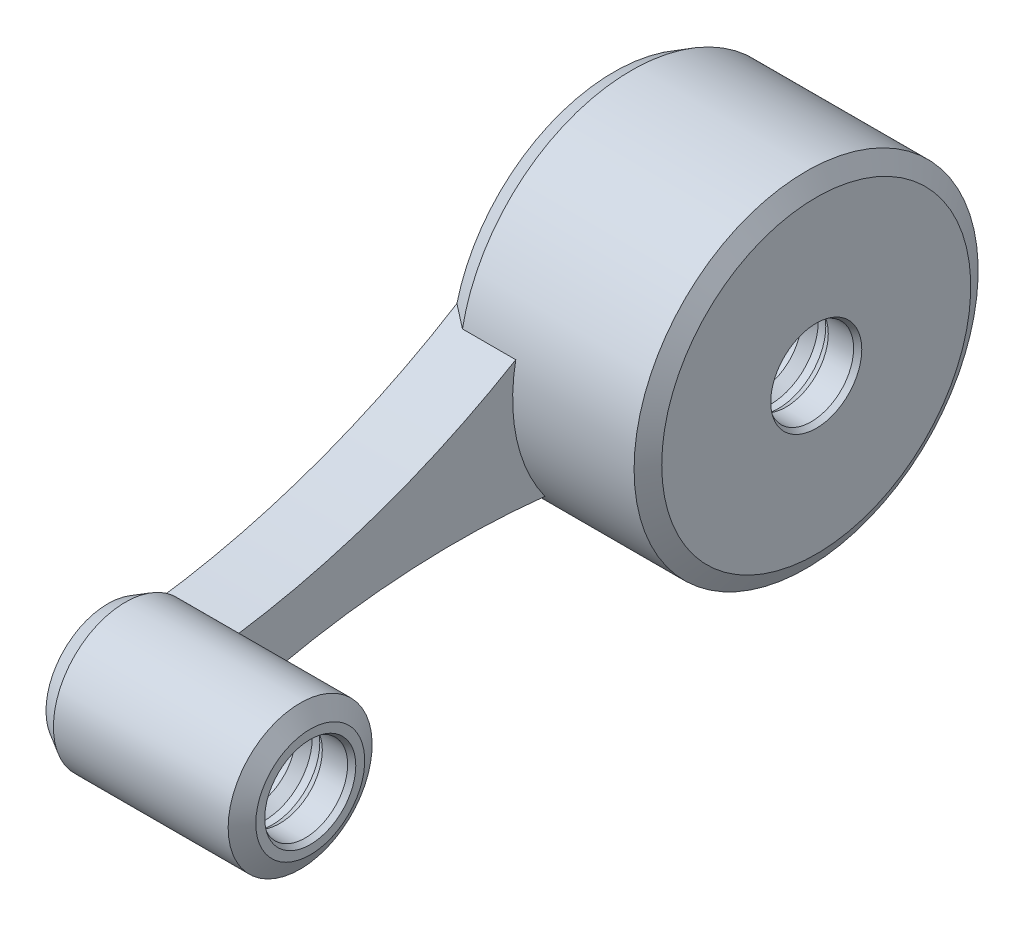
ISO-10303-21;
HEADER;
FILE_DESCRIPTION(('STEP AP214'),'2;1');
FILE_NAME('part.step','',(''),(''),'','','');
FILE_SCHEMA(('AUTOMOTIVE_DESIGN { 1 0 10303 214 1 1 1 1 }'));
ENDSEC;
DATA;
#1=APPLICATION_CONTEXT('core data for automotive mechanical design processes');
#2=APPLICATION_PROTOCOL_DEFINITION('international standard','automotive_design',2000,#1);
#3=PRODUCT_CONTEXT('',#1,'mechanical');
#4=PRODUCT('Part','Part','',(#3));
#5=PRODUCT_RELATED_PRODUCT_CATEGORY('part','',(#4));
#6=PRODUCT_DEFINITION_FORMATION('','',#4);
#7=PRODUCT_DEFINITION_CONTEXT('part definition',#1,'design');
#8=PRODUCT_DEFINITION('design','',#6,#7);
#9=PRODUCT_DEFINITION_SHAPE('','',#8);
#10=(LENGTH_UNIT() NAMED_UNIT(*) SI_UNIT(.MILLI.,.METRE.));
#11=(NAMED_UNIT(*) PLANE_ANGLE_UNIT() SI_UNIT($,.RADIAN.));
#12=(NAMED_UNIT(*) SI_UNIT($,.STERADIAN.) SOLID_ANGLE_UNIT());
#13=UNCERTAINTY_MEASURE_WITH_UNIT(LENGTH_MEASURE(1.E-05),#10,'distance_accuracy_value','');
#14=(GEOMETRIC_REPRESENTATION_CONTEXT(3) GLOBAL_UNCERTAINTY_ASSIGNED_CONTEXT((#13)) GLOBAL_UNIT_ASSIGNED_CONTEXT((#10,
#11,#12)) REPRESENTATION_CONTEXT('',''));
#15=CARTESIAN_POINT('',(0.,0.,0.));
#16=DIRECTION('',(0.,0.,1.));
#17=DIRECTION('',(1.,0.,0.));
#18=AXIS2_PLACEMENT_3D('',#15,#16,#17);
#19=CARTESIAN_POINT('',(20.,0.,0.));
#20=DIRECTION('',(1.,0.,0.));
#21=DIRECTION('',(0.,0.,1.));
#22=AXIS2_PLACEMENT_3D('',#19,#20,#21);
#23=PLANE('',#22);
#24=CARTESIAN_POINT('',(20.,0.,0.));
#25=DIRECTION('',(-1.,0.,0.));
#26=DIRECTION('',(0.,0.,1.));
#27=AXIS2_PLACEMENT_3D('',#24,#25,#26);
#28=CIRCLE('',#27,5.38218136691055);
#29=CARTESIAN_POINT('',(20.,0.,5.38218136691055));
#30=VERTEX_POINT('',#29);
#31=EDGE_CURVE('E107',#30,#30,#28,.T.);
#32=ORIENTED_EDGE('',*,*,#31,.F.);
#33=EDGE_LOOP('',(#32));
#34=FACE_BOUND('',#33,.T.);
#35=CARTESIAN_POINT('',(20.,0.,0.));
#36=DIRECTION('',(1.,0.,0.));
#37=DIRECTION('',(0.,0.,-1.));
#38=AXIS2_PLACEMENT_3D('',#35,#36,#37);
#39=CIRCLE('',#38,4.5);
#40=CARTESIAN_POINT('',(20.,0.,-4.5));
#41=VERTEX_POINT('',#40);
#42=EDGE_CURVE('E436',#41,#41,#39,.T.);
#43=ORIENTED_EDGE('',*,*,#42,.F.);
#44=EDGE_LOOP('',(#43));
#45=FACE_BOUND('',#44,.T.);
#46=ADVANCED_FACE('F38',(#34,#45),#23,.T.);
#47=CARTESIAN_POINT('',(20.,10.6190847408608,-50.));
#48=DIRECTION('',(1.,0.,0.));
#49=DIRECTION('',(0.,0.,1.));
#50=AXIS2_PLACEMENT_3D('',#47,#48,#49);
#51=PLANE('',#50);
#52=CARTESIAN_POINT('',(20.,10.6190847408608,-50.));
#53=DIRECTION('',(-1.,0.,0.));
#54=DIRECTION('',(0.,0.,1.));
#55=AXIS2_PLACEMENT_3D('',#52,#53,#54);
#56=CIRCLE('',#55,15.2679491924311);
#57=CARTESIAN_POINT('',(20.,10.6190847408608,-34.7320508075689));
#58=VERTEX_POINT('',#57);
#59=EDGE_CURVE('E182',#58,#58,#56,.T.);
#60=ORIENTED_EDGE('',*,*,#59,.F.);
#61=EDGE_LOOP('',(#60));
#62=FACE_BOUND('',#61,.T.);
#63=CARTESIAN_POINT('',(20.,10.6190847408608,-50.));
#64=DIRECTION('',(1.,0.,0.));
#65=DIRECTION('',(0.,0.,-1.));
#66=AXIS2_PLACEMENT_3D('',#63,#64,#65);
#67=CIRCLE('',#66,4.5);
#68=CARTESIAN_POINT('',(20.,10.6190847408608,-54.5));
#69=VERTEX_POINT('',#68);
#70=EDGE_CURVE('E239',#69,#69,#67,.T.);
#71=ORIENTED_EDGE('',*,*,#70,.F.);
#72=EDGE_LOOP('',(#71));
#73=FACE_BOUND('',#72,.T.);
#74=ADVANCED_FACE('F166',(#62,#73),#51,.T.);
#75=CARTESIAN_POINT('',(0.,0.,0.));
#76=DIRECTION('',(1.,0.,0.));
#77=DIRECTION('',(0.,0.,1.));
#78=AXIS2_PLACEMENT_3D('',#75,#76,#77);
#79=PLANE('',#78);
#80=CARTESIAN_POINT('',(0.,10.6190847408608,-50.));
#81=DIRECTION('',(1.,0.,0.));
#82=DIRECTION('',(0.,0.,-1.));
#83=AXIS2_PLACEMENT_3D('',#80,#81,#82);
#84=CIRCLE('',#83,4.5);
#85=CARTESIAN_POINT('',(0.,10.6190847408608,-54.5));
#86=VERTEX_POINT('',#85);
#87=EDGE_CURVE('E219',#86,#86,#84,.T.);
#88=ORIENTED_EDGE('',*,*,#87,.T.);
#89=EDGE_LOOP('',(#88));
#90=FACE_BOUND('',#89,.T.);
#91=CARTESIAN_POINT('',(0.,-79.2534363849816,-27.4855740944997));
#92=DIRECTION('',(1.,0.,0.));
#93=DIRECTION('',(0.,0.,1.));
#94=AXIS2_PLACEMENT_3D('',#91,#92,#93);
#95=CIRCLE('',#94,80.4312519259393);
#96=CARTESIAN_POINT('',(0.,0.542951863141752,-37.5713417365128));
#97=VERTEX_POINT('',#96);
#98=CARTESIAN_POINT('',(0.,-1.78755789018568,-5.84709088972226));
#99=VERTEX_POINT('',#98);
#100=EDGE_CURVE('E101',#97,#99,#95,.T.);
#101=ORIENTED_EDGE('',*,*,#100,.T.);
#102=CARTESIAN_POINT('',(0.,0.,0.));
#103=DIRECTION('',(-1.,0.,0.));
#104=DIRECTION('',(0.,0.,1.));
#105=AXIS2_PLACEMENT_3D('',#102,#103,#104);
#106=CIRCLE('',#105,6.11423217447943);
#107=CARTESIAN_POINT('',(0.,3.92829293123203,-4.685333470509));
#108=VERTEX_POINT('',#107);
#109=EDGE_CURVE('E110',#108,#99,#106,.F.);
#110=ORIENTED_EDGE('',*,*,#109,.F.);
#111=CARTESIAN_POINT('',(0.,78.5679863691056,5.13014934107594));
#112=DIRECTION('',(1.,0.,0.));
#113=DIRECTION('',(0.,0.,1.));
#114=AXIS2_PLACEMENT_3D('',#111,#112,#113);
#115=CIRCLE('',#114,75.2823189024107);
#116=CARTESIAN_POINT('',(0.,14.5561375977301,-34.4919500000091));
#117=VERTEX_POINT('',#116);
#118=EDGE_CURVE('E124',#108,#117,#115,.T.);
#119=ORIENTED_EDGE('',*,*,#118,.T.);
#120=CARTESIAN_POINT('',(0.,10.6190847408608,-50.));
#121=DIRECTION('',(-1.,0.,0.));
#122=DIRECTION('',(0.,0.,1.));
#123=AXIS2_PLACEMENT_3D('',#120,#121,#122);
#124=CIRCLE('',#123,16.);
#125=EDGE_CURVE('E121',#97,#117,#124,.F.);
#126=ORIENTED_EDGE('',*,*,#125,.F.);
#127=EDGE_LOOP('',(#101,#110,#119,#126));
#128=FACE_BOUND('',#127,.T.);
#129=CARTESIAN_POINT('',(0.,0.,0.));
#130=DIRECTION('',(1.,0.,0.));
#131=DIRECTION('',(0.,0.,-1.));
#132=AXIS2_PLACEMENT_3D('',#129,#130,#131);
#133=CIRCLE('',#132,4.5);
#134=CARTESIAN_POINT('',(0.,0.,-4.5));
#135=VERTEX_POINT('',#134);
#136=EDGE_CURVE('E272',#135,#135,#133,.T.);
#137=ORIENTED_EDGE('',*,*,#136,.T.);
#138=EDGE_LOOP('',(#137));
#139=FACE_BOUND('',#138,.T.);
#140=ADVANCED_FACE('F119',(#90,#128,#139),#79,.F.);
#141=CARTESIAN_POINT('',(6.99999999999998,39.2839931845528,2.56507467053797));
#142=DIRECTION('',(1.,0.,0.));
#143=DIRECTION('',(0.,0.,1.));
#144=AXIS2_PLACEMENT_3D('',#141,#142,#143);
#145=PLANE('',#144);
#146=CARTESIAN_POINT('',(6.99999999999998,78.5679863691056,5.13014934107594));
#147=DIRECTION('',(1.,0.,0.));
#148=DIRECTION('',(0.,0.,1.));
#149=AXIS2_PLACEMENT_3D('',#146,#147,#148);
#150=CIRCLE('',#149,75.2823189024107);
#151=CARTESIAN_POINT('',(6.99999999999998,4.08678037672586,-5.82327447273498));
#152=VERTEX_POINT('',#151);
#153=CARTESIAN_POINT('',(6.99999999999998,13.8379888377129,-33.3075269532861));
#154=VERTEX_POINT('',#153);
#155=EDGE_CURVE('E123',#152,#154,#150,.T.);
#156=ORIENTED_EDGE('',*,*,#155,.F.);
#157=CARTESIAN_POINT('',(6.99999999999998,0.,0.));
#158=DIRECTION('',(-1.,0.,0.));
#159=DIRECTION('',(0.,0.,1.));
#160=AXIS2_PLACEMENT_3D('',#157,#158,#159);
#161=CIRCLE('',#160,7.11423217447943);
#162=CARTESIAN_POINT('',(6.99999999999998,-1.48598416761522,-6.95730914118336));
#163=VERTEX_POINT('',#162);
#164=EDGE_CURVE('E199',#152,#163,#161,.T.);
#165=ORIENTED_EDGE('',*,*,#164,.T.);
#166=CARTESIAN_POINT('',(6.99999999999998,-79.2534363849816,-27.4855740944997));
#167=DIRECTION('',(1.,0.,0.));
#168=DIRECTION('',(0.,0.,1.));
#169=AXIS2_PLACEMENT_3D('',#166,#167,#168);
#170=CIRCLE('',#169,80.4312519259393);
#171=CARTESIAN_POINT('',(6.99999999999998,0.705437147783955,-36.1898735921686));
#172=VERTEX_POINT('',#171);
#173=EDGE_CURVE('E127',#172,#163,#170,.T.);
#174=ORIENTED_EDGE('',*,*,#173,.F.);
#175=CARTESIAN_POINT('',(6.99999999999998,10.6190847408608,-50.));
#176=DIRECTION('',(-1.,0.,0.));
#177=DIRECTION('',(0.,0.,1.));
#178=AXIS2_PLACEMENT_3D('',#175,#176,#177);
#179=CIRCLE('',#178,17.);
#180=EDGE_CURVE('E181',#154,#172,#179,.F.);
#181=ORIENTED_EDGE('',*,*,#180,.F.);
#182=EDGE_LOOP('',(#156,#165,#174,#181));
#183=FACE_BOUND('',#182,.T.);
#184=ADVANCED_FACE('F165',(#183),#145,.T.);
#185=CARTESIAN_POINT('',(6.99999999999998,78.5679863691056,5.13014934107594));
#186=DIRECTION('',(-1.,0.,0.));
#187=DIRECTION('',(0.,0.,-1.));
#188=AXIS2_PLACEMENT_3D('',#185,#186,#187);
#189=CYLINDRICAL_SURFACE('',#188,75.2823189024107);
#190=DIRECTION('',(-1.,0.,0.));
#191=VECTOR('',#190,1.);
#192=CARTESIAN_POINT('',(10.3660254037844,13.837988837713,-33.3075269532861));
#193=LINE('',#192,#191);
#194=CARTESIAN_POINT('',(1.73205080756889,13.8379888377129,-33.3075269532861));
#195=VERTEX_POINT('',#194);
#196=EDGE_CURVE('E129',#154,#195,#193,.T.);
#197=ORIENTED_EDGE('',*,*,#196,.T.);
#198=CARTESIAN_POINT('',(-0.000200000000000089,14.5562250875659,-34.4920913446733));
#199=CARTESIAN_POINT('',(0.141981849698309,14.4940295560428,-34.3916105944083));
#200=CARTESIAN_POINT('',(0.28477998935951,14.4324615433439,-34.2916163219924));
#201=CARTESIAN_POINT('',(0.571493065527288,14.3105184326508,-34.092535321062));
#202=CARTESIAN_POINT('',(0.715407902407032,14.2501432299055,-33.9934485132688));
#203=CARTESIAN_POINT('',(1.00426270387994,14.1305130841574,-33.7961000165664));
#204=CARTESIAN_POINT('',(1.14920266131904,14.0712581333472,-33.6978383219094));
#205=CARTESIAN_POINT('',(1.44003606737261,13.9538047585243,-33.5020664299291));
#206=CARTESIAN_POINT('',(1.58592959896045,13.8956064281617,-33.4045562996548));
#207=CARTESIAN_POINT('',(1.7322508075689,13.8379099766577,-33.3073941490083));
#208=B_SPLINE_CURVE_WITH_KNOTS('',3,(#198,#199,#200,#201,#202,#203,#204,#205,#206,#207),
.UNSPECIFIED.,.F.,.F.,(4,2,2,2,4),(0.,0.554632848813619,1.10921677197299,1.66379682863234,
2.21842580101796),.UNSPECIFIED.);
#209=EDGE_CURVE('E61',#117,#195,#208,.T.);
#210=ORIENTED_EDGE('',*,*,#209,.F.);
#211=ORIENTED_EDGE('',*,*,#118,.F.);
#212=CARTESIAN_POINT('',(-0.000199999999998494,3.92827508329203,-4.68519774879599));
#213=CARTESIAN_POINT('',(0.142778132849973,3.94103367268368,-4.78221572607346));
#214=CARTESIAN_POINT('',(0.286177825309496,3.95389989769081,-4.87859542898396));
#215=CARTESIAN_POINT('',(0.573701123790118,3.97985534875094,-5.0702239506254));
#216=CARTESIAN_POINT('',(0.717824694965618,3.99294456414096,-5.16547282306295));
#217=CARTESIAN_POINT('',(1.00668894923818,4.01935482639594,-5.35499375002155));
#218=CARTESIAN_POINT('',(1.15142962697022,4.03267587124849,-5.44926581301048));
#219=CARTESIAN_POINT('',(1.4414546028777,4.0595568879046,-5.6369511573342));
#220=CARTESIAN_POINT('',(1.58673892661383,4.07311687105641,-5.73036439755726));
#221=CARTESIAN_POINT('',(1.73225080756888,4.08679918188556,-5.82340234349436));
#222=B_SPLINE_CURVE_WITH_KNOTS('',3,(#212,#213,#214,#215,#216,#217,#218,#219,#220,#221),
.UNSPECIFIED.,.F.,.F.,(4,2,2,2,4),(0.,0.51976722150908,1.03950965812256,1.55924758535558,
2.07901026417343),.UNSPECIFIED.);
#223=CARTESIAN_POINT('',(1.73205080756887,4.08678037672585,-5.82327447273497));
#224=VERTEX_POINT('',#223);
#225=EDGE_CURVE('E106',#108,#224,#222,.T.);
#226=ORIENTED_EDGE('',*,*,#225,.T.);
#227=DIRECTION('',(-1.,0.,0.));
#228=VECTOR('',#227,1.);
#229=CARTESIAN_POINT('',(3.49999999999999,4.08678037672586,-5.82327447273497));
#230=LINE('',#229,#228);
#231=EDGE_CURVE('E134',#152,#224,#230,.T.);
#232=ORIENTED_EDGE('',*,*,#231,.F.);
#233=ORIENTED_EDGE('',*,*,#155,.T.);
#234=EDGE_LOOP('',(#197,#210,#211,#226,#232,#233));
#235=FACE_BOUND('',#234,.T.);
#236=ADVANCED_FACE('F170',(#235),#189,.F.);
#237=CARTESIAN_POINT('',(6.99999999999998,-79.2534363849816,-27.4855740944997));
#238=DIRECTION('',(-1.,0.,0.));
#239=DIRECTION('',(0.,0.,-1.));
#240=AXIS2_PLACEMENT_3D('',#237,#238,#239);
#241=CYLINDRICAL_SURFACE('',#240,80.4312519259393);
#242=DIRECTION('',(-1.,0.,0.));
#243=VECTOR('',#242,1.);
#244=CARTESIAN_POINT('',(10.3660254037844,0.705437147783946,-36.1898735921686));
#245=LINE('',#244,#243);
#246=CARTESIAN_POINT('',(1.73205080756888,0.705437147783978,-36.1898735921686));
#247=VERTEX_POINT('',#246);
#248=EDGE_CURVE('E11',#247,#172,#245,.F.);
#249=ORIENTED_EDGE('',*,*,#248,.T.);
#250=ORIENTED_EDGE('',*,*,#173,.T.);
#251=DIRECTION('',(-1.,0.,0.));
#252=VECTOR('',#251,1.);
#253=CARTESIAN_POINT('',(4.36602540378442,-1.4859841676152,-6.95730914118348));
#254=LINE('',#253,#252);
#255=CARTESIAN_POINT('',(1.73205080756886,-1.4859841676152,-6.95730914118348));
#256=VERTEX_POINT('',#255);
#257=EDGE_CURVE('E103',#256,#163,#254,.F.);
#258=ORIENTED_EDGE('',*,*,#257,.F.);
#259=CARTESIAN_POINT('',(1.73225080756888,-1.48595113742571,-6.95743427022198));
#260=CARTESIAN_POINT('',(1.58673608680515,-1.50998433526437,-6.86638948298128));
#261=CARTESIAN_POINT('',(1.44144955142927,-1.53426725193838,-6.77504447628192));
#262=CARTESIAN_POINT('',(1.15142147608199,-1.58336930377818,-6.59165185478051));
#263=CARTESIAN_POINT('',(1.00667991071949,-1.60818841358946,-6.49960427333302));
#264=CARTESIAN_POINT('',(0.717815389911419,-1.65840211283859,-6.314694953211));
#265=CARTESIAN_POINT('',(0.573692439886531,-1.68379670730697,-6.2218332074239));
#266=CARTESIAN_POINT('',(0.286172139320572,-1.73521300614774,-6.03515014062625));
#267=CARTESIAN_POINT('',(0.142774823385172,-1.7612347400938,-5.94132877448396));
#268=CARTESIAN_POINT('',(-0.000199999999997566,-1.78759476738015,-5.84695886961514));
#269=B_SPLINE_CURVE_WITH_KNOTS('',3,(#259,#260,#261,#262,#263,#264,#265,#266,#267,#268),
.UNSPECIFIED.,.F.,.F.,(4,2,2,2,4),(0.,0.519973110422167,1.03992168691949,1.55987481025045,
2.07985250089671),.UNSPECIFIED.);
#270=EDGE_CURVE('E96',#256,#99,#269,.T.);
#271=ORIENTED_EDGE('',*,*,#270,.T.);
#272=ORIENTED_EDGE('',*,*,#100,.F.);
#273=CARTESIAN_POINT('',(1.7322508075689,0.70545393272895,-36.1897194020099));
#274=CARTESIAN_POINT('',(1.58591737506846,0.693172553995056,-36.3025373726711));
#275=CARTESIAN_POINT('',(1.44001447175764,0.680592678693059,-36.4158829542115));
#276=CARTESIAN_POINT('',(1.14916825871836,0.654811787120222,-36.6437022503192));
#277=CARTESIAN_POINT('',(1.00422486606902,0.641610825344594,-36.7581758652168));
#278=CARTESIAN_POINT('',(0.715369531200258,0.614561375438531,-36.9883446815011));
#279=CARTESIAN_POINT('',(0.571457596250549,0.60071288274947,-37.1040398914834));
#280=CARTESIAN_POINT('',(0.284757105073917,0.572337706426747,-37.3367570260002));
#281=CARTESIAN_POINT('',(0.14196864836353,0.557810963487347,-37.453779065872));
#282=CARTESIAN_POINT('',(-0.00019999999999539,0.54293092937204,-37.5715073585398));
#283=B_SPLINE_CURVE_WITH_KNOTS('',3,(#273,#274,#275,#276,#277,#278,#279,#280,#281,#282),
.UNSPECIFIED.,.F.,.F.,(4,2,2,2,4),(0.,0.555544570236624,1.11104048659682,1.66654031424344,
2.22208880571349),.UNSPECIFIED.);
#284=EDGE_CURVE('E47',#247,#97,#283,.T.);
#285=ORIENTED_EDGE('',*,*,#284,.F.);
#286=EDGE_LOOP('',(#249,#250,#258,#271,#272,#285));
#287=FACE_BOUND('',#286,.T.);
#288=ADVANCED_FACE('F98',(#287),#241,.F.);
#289=CARTESIAN_POINT('',(20.,0.,0.));
#290=DIRECTION('',(-1.,0.,0.));
#291=DIRECTION('',(0.,0.,-1.));
#292=AXIS2_PLACEMENT_3D('',#289,#290,#291);
#293=CYLINDRICAL_SURFACE('',#292,7.11423217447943);
#294=CARTESIAN_POINT('',(19.,0.,0.));
#295=DIRECTION('',(-1.,0.,0.));
#296=DIRECTION('',(0.,0.,1.));
#297=AXIS2_PLACEMENT_3D('',#294,#295,#296);
#298=CIRCLE('',#297,7.11423217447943);
#299=CARTESIAN_POINT('',(19.,0.,7.11423217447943));
#300=VERTEX_POINT('',#299);
#301=EDGE_CURVE('E137',#300,#300,#298,.F.);
#302=ORIENTED_EDGE('',*,*,#301,.F.);
#303=EDGE_LOOP('',(#302));
#304=FACE_BOUND('',#303,.T.);
#305=ORIENTED_EDGE('',*,*,#231,.T.);
#306=CARTESIAN_POINT('',(1.73205080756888,0.,0.));
#307=DIRECTION('',(-1.,0.,0.));
#308=DIRECTION('',(0.,0.,1.));
#309=AXIS2_PLACEMENT_3D('',#306,#307,#308);
#310=CIRCLE('',#309,7.11423217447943);
#311=EDGE_CURVE('E116',#256,#224,#310,.T.);
#312=ORIENTED_EDGE('',*,*,#311,.F.);
#313=ORIENTED_EDGE('',*,*,#257,.T.);
#314=ORIENTED_EDGE('',*,*,#164,.F.);
#315=EDGE_LOOP('',(#305,#312,#313,#314));
#316=FACE_BOUND('',#315,.T.);
#317=ADVANCED_FACE('F158',(#304,#316),#293,.T.);
#318=CARTESIAN_POINT('',(1.73205080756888,0.,0.));
#319=DIRECTION('',(1.,0.,0.));
#320=DIRECTION('',(0.,0.,1.));
#321=AXIS2_PLACEMENT_3D('',#318,#319,#320);
#322=CONICAL_SURFACE('',#321,7.11423217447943,0.523598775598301);
#323=ORIENTED_EDGE('',*,*,#109,.T.);
#324=ORIENTED_EDGE('',*,*,#270,.F.);
#325=ORIENTED_EDGE('',*,*,#311,.T.);
#326=ORIENTED_EDGE('',*,*,#225,.F.);
#327=EDGE_LOOP('',(#323,#324,#325,#326));
#328=FACE_BOUND('',#327,.T.);
#329=ADVANCED_FACE('F111',(#328),#322,.T.);
#330=CARTESIAN_POINT('',(20.,0.,0.));
#331=DIRECTION('',(-1.,0.,0.));
#332=DIRECTION('',(0.,0.,-1.));
#333=AXIS2_PLACEMENT_3D('',#330,#331,#332);
#334=CONICAL_SURFACE('',#333,5.38218136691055,1.0471975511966);
#335=ORIENTED_EDGE('',*,*,#301,.T.);
#336=EDGE_LOOP('',(#335));
#337=FACE_BOUND('',#336,.T.);
#338=ORIENTED_EDGE('',*,*,#31,.T.);
#339=EDGE_LOOP('',(#338));
#340=FACE_BOUND('',#339,.T.);
#341=ADVANCED_FACE('F40',(#337,#340),#334,.T.);
#342=CARTESIAN_POINT('',(20.,10.6190847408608,-50.));
#343=DIRECTION('',(-1.,0.,0.));
#344=DIRECTION('',(0.,0.,-1.));
#345=AXIS2_PLACEMENT_3D('',#342,#343,#344);
#346=CYLINDRICAL_SURFACE('',#345,17.);
#347=CARTESIAN_POINT('',(19.,10.6190847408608,-50.));
#348=DIRECTION('',(-1.,0.,0.));
#349=DIRECTION('',(0.,0.,1.));
#350=AXIS2_PLACEMENT_3D('',#347,#348,#349);
#351=CIRCLE('',#350,17.);
#352=CARTESIAN_POINT('',(19.,10.6190847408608,-33.));
#353=VERTEX_POINT('',#352);
#354=EDGE_CURVE('E216',#353,#353,#351,.F.);
#355=ORIENTED_EDGE('',*,*,#354,.F.);
#356=EDGE_LOOP('',(#355));
#357=FACE_BOUND('',#356,.T.);
#358=ORIENTED_EDGE('',*,*,#180,.T.);
#359=ORIENTED_EDGE('',*,*,#248,.F.);
#360=CARTESIAN_POINT('',(1.7320508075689,10.6190847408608,-50.));
#361=DIRECTION('',(-1.,0.,0.));
#362=DIRECTION('',(0.,0.,1.));
#363=AXIS2_PLACEMENT_3D('',#360,#361,#362);
#364=CIRCLE('',#363,17.);
#365=EDGE_CURVE('E54',#195,#247,#364,.T.);
#366=ORIENTED_EDGE('',*,*,#365,.F.);
#367=ORIENTED_EDGE('',*,*,#196,.F.);
#368=EDGE_LOOP('',(#358,#359,#366,#367));
#369=FACE_BOUND('',#368,.T.);
#370=ADVANCED_FACE('F191',(#357,#369),#346,.T.);
#371=CARTESIAN_POINT('',(1.7320508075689,10.6190847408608,-50.));
#372=DIRECTION('',(1.,0.,0.));
#373=DIRECTION('',(0.,0.,1.));
#374=AXIS2_PLACEMENT_3D('',#371,#372,#373);
#375=CONICAL_SURFACE('',#374,17.,0.523598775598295);
#376=ORIENTED_EDGE('',*,*,#209,.T.);
#377=ORIENTED_EDGE('',*,*,#365,.T.);
#378=ORIENTED_EDGE('',*,*,#284,.T.);
#379=ORIENTED_EDGE('',*,*,#125,.T.);
#380=EDGE_LOOP('',(#376,#377,#378,#379));
#381=FACE_BOUND('',#380,.T.);
#382=ADVANCED_FACE('F185',(#381),#375,.T.);
#383=CARTESIAN_POINT('',(20.,10.6190847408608,-50.));
#384=DIRECTION('',(-1.,0.,0.));
#385=DIRECTION('',(0.,0.,-1.));
#386=AXIS2_PLACEMENT_3D('',#383,#384,#385);
#387=CONICAL_SURFACE('',#386,15.2679491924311,1.0471975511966);
#388=ORIENTED_EDGE('',*,*,#354,.T.);
#389=EDGE_LOOP('',(#388));
#390=FACE_BOUND('',#389,.T.);
#391=ORIENTED_EDGE('',*,*,#59,.T.);
#392=EDGE_LOOP('',(#391));
#393=FACE_BOUND('',#392,.T.);
#394=ADVANCED_FACE('F190',(#390,#393),#387,.T.);
#395=CARTESIAN_POINT('',(0.499999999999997,10.6190847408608,-50.));
#396=DIRECTION('',(-1.,0.,0.));
#397=DIRECTION('',(0.,0.,-1.));
#398=AXIS2_PLACEMENT_3D('',#395,#396,#397);
#399=CONICAL_SURFACE('',#398,4.1916419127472,0.552620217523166);
#400=ORIENTED_EDGE('',*,*,#87,.F.);
#401=EDGE_LOOP('',(#400));
#402=FACE_BOUND('',#401,.T.);
#403=CARTESIAN_POINT('',(0.499999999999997,10.6190847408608,-50.));
#404=DIRECTION('',(1.,0.,0.));
#405=DIRECTION('',(0.,0.,-1.));
#406=AXIS2_PLACEMENT_3D('',#403,#404,#405);
#407=CIRCLE('',#406,4.1916419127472);
#408=CARTESIAN_POINT('',(0.499999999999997,10.6190847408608,-54.1916419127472));
#409=VERTEX_POINT('',#408);
#410=EDGE_CURVE('E276',#409,#409,#407,.T.);
#411=ORIENTED_EDGE('',*,*,#410,.T.);
#412=EDGE_LOOP('',(#411));
#413=FACE_BOUND('',#412,.T.);
#414=ADVANCED_FACE('F303',(#402,#413),#399,.F.);
#415=CARTESIAN_POINT('',(5.99999999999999,10.6190847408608,-50.));
#416=DIRECTION('',(-1.,0.,0.));
#417=DIRECTION('',(0.,0.,-1.));
#418=AXIS2_PLACEMENT_3D('',#415,#416,#417);
#419=PLANE('',#418);
#420=CARTESIAN_POINT('',(5.99999999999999,10.6190847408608,-50.));
#421=DIRECTION('',(1.,0.,0.));
#422=DIRECTION('',(0.,0.,-1.));
#423=AXIS2_PLACEMENT_3D('',#420,#421,#422);
#424=CIRCLE('',#423,3.99164191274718);
#425=CARTESIAN_POINT('',(5.99999999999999,10.6190847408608,-53.9916419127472));
#426=VERTEX_POINT('',#425);
#427=EDGE_CURVE('E226',#426,#426,#424,.T.);
#428=ORIENTED_EDGE('',*,*,#427,.F.);
#429=EDGE_LOOP('',(#428));
#430=FACE_BOUND('',#429,.T.);
#431=ADVANCED_FACE('F301',(#430),#419,.T.);
#432=CARTESIAN_POINT('',(0.,10.6190847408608,-50.));
#433=DIRECTION('',(-1.,0.,0.));
#434=DIRECTION('',(0.,0.,-1.));
#435=AXIS2_PLACEMENT_3D('',#432,#433,#434);
#436=CYLINDRICAL_SURFACE('',#435,3.99164191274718);
#437=CARTESIAN_POINT('',(5.46561999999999,10.6190847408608,-50.));
#438=DIRECTION('',(1.,0.,0.));
#439=DIRECTION('',(0.,0.,-1.));
#440=AXIS2_PLACEMENT_3D('',#437,#438,#439);
#441=CIRCLE('',#440,3.99164191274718);
#442=CARTESIAN_POINT('',(5.46561999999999,10.6190847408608,-53.9916419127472));
#443=VERTEX_POINT('',#442);
#444=EDGE_CURVE('E292',#443,#443,#441,.T.);
#445=ORIENTED_EDGE('',*,*,#444,.F.);
#446=EDGE_LOOP('',(#445));
#447=FACE_BOUND('',#446,.T.);
#448=ORIENTED_EDGE('',*,*,#427,.T.);
#449=EDGE_LOOP('',(#448));
#450=FACE_BOUND('',#449,.T.);
#451=ADVANCED_FACE('F299',(#447,#450),#436,.F.);
#452=CARTESIAN_POINT('',(5.46561999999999,10.6190847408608,-50.));
#453=DIRECTION('',(-1.,0.,0.));
#454=DIRECTION('',(0.,0.,-1.));
#455=AXIS2_PLACEMENT_3D('',#452,#453,#454);
#456=CONICAL_SURFACE('',#455,3.99164191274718,0.627257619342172);
#457=CARTESIAN_POINT('',(4.49999999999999,10.6190847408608,-50.));
#458=DIRECTION('',(1.,0.,0.));
#459=DIRECTION('',(0.,0.,-1.));
#460=AXIS2_PLACEMENT_3D('',#457,#458,#459);
#461=CIRCLE('',#460,4.69164191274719);
#462=CARTESIAN_POINT('',(4.49999999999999,10.6190847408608,-54.6916419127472));
#463=VERTEX_POINT('',#462);
#464=EDGE_CURVE('E288',#463,#463,#461,.T.);
#465=ORIENTED_EDGE('',*,*,#464,.F.);
#466=EDGE_LOOP('',(#465));
#467=FACE_BOUND('',#466,.T.);
#468=ORIENTED_EDGE('',*,*,#444,.T.);
#469=EDGE_LOOP('',(#468));
#470=FACE_BOUND('',#469,.T.);
#471=ADVANCED_FACE('F309',(#467,#470),#456,.F.);
#472=CARTESIAN_POINT('',(0.,10.6190847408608,-50.));
#473=DIRECTION('',(-1.,0.,0.));
#474=DIRECTION('',(0.,0.,-1.));
#475=AXIS2_PLACEMENT_3D('',#472,#473,#474);
#476=CYLINDRICAL_SURFACE('',#475,4.69164191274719);
#477=CARTESIAN_POINT('',(3.74999999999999,10.6190847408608,-50.));
#478=DIRECTION('',(1.,0.,0.));
#479=DIRECTION('',(0.,0.,-1.));
#480=AXIS2_PLACEMENT_3D('',#477,#478,#479);
#481=CIRCLE('',#480,4.69164191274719);
#482=CARTESIAN_POINT('',(3.74999999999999,10.6190847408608,-54.6916419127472));
#483=VERTEX_POINT('',#482);
#484=EDGE_CURVE('E284',#483,#483,#481,.T.);
#485=ORIENTED_EDGE('',*,*,#484,.F.);
#486=EDGE_LOOP('',(#485));
#487=FACE_BOUND('',#486,.T.);
#488=ORIENTED_EDGE('',*,*,#464,.T.);
#489=EDGE_LOOP('',(#488));
#490=FACE_BOUND('',#489,.T.);
#491=ADVANCED_FACE('F317',(#487,#490),#476,.F.);
#492=CARTESIAN_POINT('',(3.74999999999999,10.6190847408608,-50.));
#493=DIRECTION('',(1.,0.,0.));
#494=DIRECTION('',(0.,0.,1.));
#495=AXIS2_PLACEMENT_3D('',#492,#493,#494);
#496=CONICAL_SURFACE('',#495,4.69164191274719,0.588002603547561);
#497=CARTESIAN_POINT('',(3.,10.6190847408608,-50.));
#498=DIRECTION('',(1.,0.,0.));
#499=DIRECTION('',(0.,0.,-1.));
#500=AXIS2_PLACEMENT_3D('',#497,#498,#499);
#501=CIRCLE('',#500,4.1916419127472);
#502=CARTESIAN_POINT('',(3.,10.6190847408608,-54.1916419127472));
#503=VERTEX_POINT('',#502);
#504=EDGE_CURVE('E280',#503,#503,#501,.T.);
#505=ORIENTED_EDGE('',*,*,#504,.F.);
#506=EDGE_LOOP('',(#505));
#507=FACE_BOUND('',#506,.T.);
#508=ORIENTED_EDGE('',*,*,#484,.T.);
#509=EDGE_LOOP('',(#508));
#510=FACE_BOUND('',#509,.T.);
#511=ADVANCED_FACE('F321',(#507,#510),#496,.F.);
#512=CARTESIAN_POINT('',(0.,10.6190847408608,-50.));
#513=DIRECTION('',(-1.,0.,0.));
#514=DIRECTION('',(0.,0.,-1.));
#515=AXIS2_PLACEMENT_3D('',#512,#513,#514);
#516=CYLINDRICAL_SURFACE('',#515,4.1916419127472);
#517=ORIENTED_EDGE('',*,*,#410,.F.);
#518=EDGE_LOOP('',(#517));
#519=FACE_BOUND('',#518,.T.);
#520=ORIENTED_EDGE('',*,*,#504,.T.);
#521=EDGE_LOOP('',(#520));
#522=FACE_BOUND('',#521,.T.);
#523=ADVANCED_FACE('F325',(#519,#522),#516,.F.);
#524=CARTESIAN_POINT('',(0.499999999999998,0.,0.));
#525=DIRECTION('',(-1.,0.,0.));
#526=DIRECTION('',(0.,0.,-1.));
#527=AXIS2_PLACEMENT_3D('',#524,#525,#526);
#528=CONICAL_SURFACE('',#527,4.19164191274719,0.552620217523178);
#529=ORIENTED_EDGE('',*,*,#136,.F.);
#530=EDGE_LOOP('',(#529));
#531=FACE_BOUND('',#530,.T.);
#532=CARTESIAN_POINT('',(0.499999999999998,0.,0.));
#533=DIRECTION('',(1.,0.,0.));
#534=DIRECTION('',(0.,0.,-1.));
#535=AXIS2_PLACEMENT_3D('',#532,#533,#534);
#536=CIRCLE('',#535,4.19164191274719);
#537=CARTESIAN_POINT('',(0.499999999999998,0.,-4.19164191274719));
#538=VERTEX_POINT('',#537);
#539=EDGE_CURVE('E241',#538,#538,#536,.T.);
#540=ORIENTED_EDGE('',*,*,#539,.T.);
#541=EDGE_LOOP('',(#540));
#542=FACE_BOUND('',#541,.T.);
#543=ADVANCED_FACE('F329',(#531,#542),#528,.F.);
#544=CARTESIAN_POINT('',(5.99999999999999,0.,0.));
#545=DIRECTION('',(-1.,0.,0.));
#546=DIRECTION('',(0.,0.,-1.));
#547=AXIS2_PLACEMENT_3D('',#544,#545,#546);
#548=PLANE('',#547);
#549=CARTESIAN_POINT('',(5.99999999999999,0.,0.));
#550=DIRECTION('',(1.,0.,0.));
#551=DIRECTION('',(0.,0.,-1.));
#552=AXIS2_PLACEMENT_3D('',#549,#550,#551);
#553=CIRCLE('',#552,3.99164191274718);
#554=CARTESIAN_POINT('',(5.99999999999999,0.,-3.99164191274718));
#555=VERTEX_POINT('',#554);
#556=EDGE_CURVE('E269',#555,#555,#553,.T.);
#557=ORIENTED_EDGE('',*,*,#556,.F.);
#558=EDGE_LOOP('',(#557));
#559=FACE_BOUND('',#558,.T.);
#560=ADVANCED_FACE('F333',(#559),#548,.T.);
#561=CARTESIAN_POINT('',(0.,0.,0.));
#562=DIRECTION('',(-1.,0.,0.));
#563=DIRECTION('',(0.,0.,-1.));
#564=AXIS2_PLACEMENT_3D('',#561,#562,#563);
#565=CYLINDRICAL_SURFACE('',#564,3.99164191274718);
#566=CARTESIAN_POINT('',(5.46561999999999,0.,0.));
#567=DIRECTION('',(1.,0.,0.));
#568=DIRECTION('',(0.,0.,-1.));
#569=AXIS2_PLACEMENT_3D('',#566,#567,#568);
#570=CIRCLE('',#569,3.99164191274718);
#571=CARTESIAN_POINT('',(5.46561999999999,0.,-3.99164191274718));
#572=VERTEX_POINT('',#571);
#573=EDGE_CURVE('E266',#572,#572,#570,.T.);
#574=ORIENTED_EDGE('',*,*,#573,.F.);
#575=EDGE_LOOP('',(#574));
#576=FACE_BOUND('',#575,.T.);
#577=ORIENTED_EDGE('',*,*,#556,.T.);
#578=EDGE_LOOP('',(#577));
#579=FACE_BOUND('',#578,.T.);
#580=ADVANCED_FACE('F337',(#576,#579),#565,.F.);
#581=CARTESIAN_POINT('',(5.46561999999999,0.,0.));
#582=DIRECTION('',(-1.,0.,0.));
#583=DIRECTION('',(0.,0.,-1.));
#584=AXIS2_PLACEMENT_3D('',#581,#582,#583);
#585=CONICAL_SURFACE('',#584,3.99164191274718,0.627257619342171);
#586=CARTESIAN_POINT('',(4.49999999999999,0.,0.));
#587=DIRECTION('',(1.,0.,0.));
#588=DIRECTION('',(0.,0.,-1.));
#589=AXIS2_PLACEMENT_3D('',#586,#587,#588);
#590=CIRCLE('',#589,4.69164191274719);
#591=CARTESIAN_POINT('',(4.49999999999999,0.,-4.69164191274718));
#592=VERTEX_POINT('',#591);
#593=EDGE_CURVE('E262',#592,#592,#590,.T.);
#594=ORIENTED_EDGE('',*,*,#593,.F.);
#595=EDGE_LOOP('',(#594));
#596=FACE_BOUND('',#595,.T.);
#597=ORIENTED_EDGE('',*,*,#573,.T.);
#598=EDGE_LOOP('',(#597));
#599=FACE_BOUND('',#598,.T.);
#600=ADVANCED_FACE('F341',(#596,#599),#585,.F.);
#601=CARTESIAN_POINT('',(0.,0.,0.));
#602=DIRECTION('',(-1.,0.,0.));
#603=DIRECTION('',(0.,0.,-1.));
#604=AXIS2_PLACEMENT_3D('',#601,#602,#603);
#605=CYLINDRICAL_SURFACE('',#604,4.69164191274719);
#606=CARTESIAN_POINT('',(3.74999999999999,0.,0.));
#607=DIRECTION('',(1.,0.,0.));
#608=DIRECTION('',(0.,0.,-1.));
#609=AXIS2_PLACEMENT_3D('',#606,#607,#608);
#610=CIRCLE('',#609,4.69164191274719);
#611=CARTESIAN_POINT('',(3.74999999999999,0.,-4.69164191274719));
#612=VERTEX_POINT('',#611);
#613=EDGE_CURVE('E258',#612,#612,#610,.T.);
#614=ORIENTED_EDGE('',*,*,#613,.F.);
#615=EDGE_LOOP('',(#614));
#616=FACE_BOUND('',#615,.T.);
#617=ORIENTED_EDGE('',*,*,#593,.T.);
#618=EDGE_LOOP('',(#617));
#619=FACE_BOUND('',#618,.T.);
#620=ADVANCED_FACE('F345',(#616,#619),#605,.F.);
#621=CARTESIAN_POINT('',(3.74999999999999,0.,0.));
#622=DIRECTION('',(1.,0.,0.));
#623=DIRECTION('',(0.,0.,1.));
#624=AXIS2_PLACEMENT_3D('',#621,#622,#623);
#625=CONICAL_SURFACE('',#624,4.69164191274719,0.588002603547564);
#626=CARTESIAN_POINT('',(3.,0.,0.));
#627=DIRECTION('',(1.,0.,0.));
#628=DIRECTION('',(0.,0.,-1.));
#629=AXIS2_PLACEMENT_3D('',#626,#627,#628);
#630=CIRCLE('',#629,4.19164191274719);
#631=CARTESIAN_POINT('',(3.,0.,-4.19164191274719));
#632=VERTEX_POINT('',#631);
#633=EDGE_CURVE('E247',#632,#632,#630,.T.);
#634=ORIENTED_EDGE('',*,*,#633,.F.);
#635=EDGE_LOOP('',(#634));
#636=FACE_BOUND('',#635,.T.);
#637=ORIENTED_EDGE('',*,*,#613,.T.);
#638=EDGE_LOOP('',(#637));
#639=FACE_BOUND('',#638,.T.);
#640=ADVANCED_FACE('F349',(#636,#639),#625,.F.);
#641=CARTESIAN_POINT('',(0.,0.,0.));
#642=DIRECTION('',(-1.,0.,0.));
#643=DIRECTION('',(0.,0.,-1.));
#644=AXIS2_PLACEMENT_3D('',#641,#642,#643);
#645=CYLINDRICAL_SURFACE('',#644,4.19164191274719);
#646=ORIENTED_EDGE('',*,*,#539,.F.);
#647=EDGE_LOOP('',(#646));
#648=FACE_BOUND('',#647,.T.);
#649=ORIENTED_EDGE('',*,*,#633,.T.);
#650=EDGE_LOOP('',(#649));
#651=FACE_BOUND('',#650,.T.);
#652=ADVANCED_FACE('F353',(#648,#651),#645,.F.);
#653=CARTESIAN_POINT('',(19.5,10.6190847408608,-50.));
#654=DIRECTION('',(1.,0.,0.));
#655=DIRECTION('',(0.,0.,-1.));
#656=AXIS2_PLACEMENT_3D('',#653,#654,#655);
#657=CONICAL_SURFACE('',#656,4.1916419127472,0.552620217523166);
#658=ORIENTED_EDGE('',*,*,#70,.T.);
#659=EDGE_LOOP('',(#658));
#660=FACE_BOUND('',#659,.T.);
#661=CARTESIAN_POINT('',(19.5,10.6190847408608,-50.));
#662=DIRECTION('',(1.,0.,0.));
#663=DIRECTION('',(0.,0.,-1.));
#664=AXIS2_PLACEMENT_3D('',#661,#662,#663);
#665=CIRCLE('',#664,4.1916419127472);
#666=CARTESIAN_POINT('',(19.5,10.6190847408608,-54.1916419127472));
#667=VERTEX_POINT('',#666);
#668=EDGE_CURVE('E439',#667,#667,#665,.T.);
#669=ORIENTED_EDGE('',*,*,#668,.F.);
#670=EDGE_LOOP('',(#669));
#671=FACE_BOUND('',#670,.T.);
#672=ADVANCED_FACE('F357',(#660,#671),#657,.F.);
#673=CARTESIAN_POINT('',(14.,10.6190847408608,-50.));
#674=DIRECTION('',(1.,0.,0.));
#675=DIRECTION('',(0.,0.,-1.));
#676=AXIS2_PLACEMENT_3D('',#673,#674,#675);
#677=PLANE('',#676);
#678=CARTESIAN_POINT('',(14.,10.6190847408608,-50.));
#679=DIRECTION('',(1.,0.,0.));
#680=DIRECTION('',(0.,0.,-1.));
#681=AXIS2_PLACEMENT_3D('',#678,#679,#680);
#682=CIRCLE('',#681,3.99164191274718);
#683=CARTESIAN_POINT('',(14.,10.6190847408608,-53.9916419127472));
#684=VERTEX_POINT('',#683);
#685=EDGE_CURVE('E242',#684,#684,#682,.T.);
#686=ORIENTED_EDGE('',*,*,#685,.T.);
#687=EDGE_LOOP('',(#686));
#688=FACE_BOUND('',#687,.T.);
#689=ADVANCED_FACE('F361',(#688),#677,.T.);
#690=CARTESIAN_POINT('',(20.,10.6190847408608,-50.));
#691=DIRECTION('',(1.,0.,0.));
#692=DIRECTION('',(0.,0.,-1.));
#693=AXIS2_PLACEMENT_3D('',#690,#691,#692);
#694=CYLINDRICAL_SURFACE('',#693,3.99164191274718);
#695=CARTESIAN_POINT('',(14.53438,10.6190847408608,-50.));
#696=DIRECTION('',(1.,0.,0.));
#697=DIRECTION('',(0.,0.,-1.));
#698=AXIS2_PLACEMENT_3D('',#695,#696,#697);
#699=CIRCLE('',#698,3.99164191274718);
#700=CARTESIAN_POINT('',(14.53438,10.6190847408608,-53.9916419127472));
#701=VERTEX_POINT('',#700);
#702=EDGE_CURVE('E251',#701,#701,#699,.T.);
#703=ORIENTED_EDGE('',*,*,#702,.T.);
#704=EDGE_LOOP('',(#703));
#705=FACE_BOUND('',#704,.T.);
#706=ORIENTED_EDGE('',*,*,#685,.F.);
#707=EDGE_LOOP('',(#706));
#708=FACE_BOUND('',#707,.T.);
#709=ADVANCED_FACE('F364',(#705,#708),#694,.F.);
#710=CARTESIAN_POINT('',(14.53438,10.6190847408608,-50.));
#711=DIRECTION('',(1.,0.,0.));
#712=DIRECTION('',(0.,0.,-1.));
#713=AXIS2_PLACEMENT_3D('',#710,#711,#712);
#714=CONICAL_SURFACE('',#713,3.99164191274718,0.627257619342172);
#715=CARTESIAN_POINT('',(15.5,10.6190847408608,-50.));
#716=DIRECTION('',(1.,0.,0.));
#717=DIRECTION('',(0.,0.,-1.));
#718=AXIS2_PLACEMENT_3D('',#715,#716,#717);
#719=CIRCLE('',#718,4.69164191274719);
#720=CARTESIAN_POINT('',(15.5,10.6190847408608,-54.6916419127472));
#721=VERTEX_POINT('',#720);
#722=EDGE_CURVE('E450',#721,#721,#719,.T.);
#723=ORIENTED_EDGE('',*,*,#722,.T.);
#724=EDGE_LOOP('',(#723));
#725=FACE_BOUND('',#724,.T.);
#726=ORIENTED_EDGE('',*,*,#702,.F.);
#727=EDGE_LOOP('',(#726));
#728=FACE_BOUND('',#727,.T.);
#729=ADVANCED_FACE('F368',(#725,#728),#714,.F.);
#730=CARTESIAN_POINT('',(20.,10.6190847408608,-50.));
#731=DIRECTION('',(1.,0.,0.));
#732=DIRECTION('',(0.,0.,-1.));
#733=AXIS2_PLACEMENT_3D('',#730,#731,#732);
#734=CYLINDRICAL_SURFACE('',#733,4.69164191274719);
#735=CARTESIAN_POINT('',(16.25,10.6190847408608,-50.));
#736=DIRECTION('',(1.,0.,0.));
#737=DIRECTION('',(0.,0.,-1.));
#738=AXIS2_PLACEMENT_3D('',#735,#736,#737);
#739=CIRCLE('',#738,4.69164191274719);
#740=CARTESIAN_POINT('',(16.25,10.6190847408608,-54.6916419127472));
#741=VERTEX_POINT('',#740);
#742=EDGE_CURVE('E446',#741,#741,#739,.T.);
#743=ORIENTED_EDGE('',*,*,#742,.T.);
#744=EDGE_LOOP('',(#743));
#745=FACE_BOUND('',#744,.T.);
#746=ORIENTED_EDGE('',*,*,#722,.F.);
#747=EDGE_LOOP('',(#746));
#748=FACE_BOUND('',#747,.T.);
#749=ADVANCED_FACE('F372',(#745,#748),#734,.F.);
#750=CARTESIAN_POINT('',(16.25,10.6190847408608,-50.));
#751=DIRECTION('',(-1.,0.,0.));
#752=DIRECTION('',(0.,0.,1.));
#753=AXIS2_PLACEMENT_3D('',#750,#751,#752);
#754=CONICAL_SURFACE('',#753,4.69164191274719,0.588002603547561);
#755=CARTESIAN_POINT('',(17.,10.6190847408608,-50.));
#756=DIRECTION('',(1.,0.,0.));
#757=DIRECTION('',(0.,0.,-1.));
#758=AXIS2_PLACEMENT_3D('',#755,#756,#757);
#759=CIRCLE('',#758,4.1916419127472);
#760=CARTESIAN_POINT('',(17.,10.6190847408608,-54.1916419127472));
#761=VERTEX_POINT('',#760);
#762=EDGE_CURVE('E442',#761,#761,#759,.T.);
#763=ORIENTED_EDGE('',*,*,#762,.T.);
#764=EDGE_LOOP('',(#763));
#765=FACE_BOUND('',#764,.T.);
#766=ORIENTED_EDGE('',*,*,#742,.F.);
#767=EDGE_LOOP('',(#766));
#768=FACE_BOUND('',#767,.T.);
#769=ADVANCED_FACE('F376',(#765,#768),#754,.F.);
#770=CARTESIAN_POINT('',(20.,10.6190847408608,-50.));
#771=DIRECTION('',(1.,0.,0.));
#772=DIRECTION('',(0.,0.,-1.));
#773=AXIS2_PLACEMENT_3D('',#770,#771,#772);
#774=CYLINDRICAL_SURFACE('',#773,4.1916419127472);
#775=ORIENTED_EDGE('',*,*,#668,.T.);
#776=EDGE_LOOP('',(#775));
#777=FACE_BOUND('',#776,.T.);
#778=ORIENTED_EDGE('',*,*,#762,.F.);
#779=EDGE_LOOP('',(#778));
#780=FACE_BOUND('',#779,.T.);
#781=ADVANCED_FACE('F380',(#777,#780),#774,.F.);
#782=CARTESIAN_POINT('',(19.5,0.,0.));
#783=DIRECTION('',(1.,0.,0.));
#784=DIRECTION('',(0.,0.,-1.));
#785=AXIS2_PLACEMENT_3D('',#782,#783,#784);
#786=CONICAL_SURFACE('',#785,4.19164191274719,0.552620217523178);
#787=ORIENTED_EDGE('',*,*,#42,.T.);
#788=EDGE_LOOP('',(#787));
#789=FACE_BOUND('',#788,.T.);
#790=CARTESIAN_POINT('',(19.5,0.,0.));
#791=DIRECTION('',(1.,0.,0.));
#792=DIRECTION('',(0.,0.,-1.));
#793=AXIS2_PLACEMENT_3D('',#790,#791,#792);
#794=CIRCLE('',#793,4.19164191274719);
#795=CARTESIAN_POINT('',(19.5,0.,-4.19164191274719));
#796=VERTEX_POINT('',#795);
#797=EDGE_CURVE('E417',#796,#796,#794,.T.);
#798=ORIENTED_EDGE('',*,*,#797,.F.);
#799=EDGE_LOOP('',(#798));
#800=FACE_BOUND('',#799,.T.);
#801=ADVANCED_FACE('F384',(#789,#800),#786,.F.);
#802=CARTESIAN_POINT('',(14.,0.,0.));
#803=DIRECTION('',(1.,0.,0.));
#804=DIRECTION('',(0.,0.,-1.));
#805=AXIS2_PLACEMENT_3D('',#802,#803,#804);
#806=PLANE('',#805);
#807=CARTESIAN_POINT('',(14.,0.,0.));
#808=DIRECTION('',(1.,0.,0.));
#809=DIRECTION('',(0.,0.,-1.));
#810=AXIS2_PLACEMENT_3D('',#807,#808,#809);
#811=CIRCLE('',#810,3.99164191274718);
#812=CARTESIAN_POINT('',(14.,0.,-3.99164191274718));
#813=VERTEX_POINT('',#812);
#814=EDGE_CURVE('E433',#813,#813,#811,.T.);
#815=ORIENTED_EDGE('',*,*,#814,.T.);
#816=EDGE_LOOP('',(#815));
#817=FACE_BOUND('',#816,.T.);
#818=ADVANCED_FACE('F388',(#817),#806,.T.);
#819=CARTESIAN_POINT('',(20.,0.,0.));
#820=DIRECTION('',(1.,0.,0.));
#821=DIRECTION('',(0.,0.,-1.));
#822=AXIS2_PLACEMENT_3D('',#819,#820,#821);
#823=CYLINDRICAL_SURFACE('',#822,3.99164191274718);
#824=CARTESIAN_POINT('',(14.53438,0.,0.));
#825=DIRECTION('',(1.,0.,0.));
#826=DIRECTION('',(0.,0.,-1.));
#827=AXIS2_PLACEMENT_3D('',#824,#825,#826);
#828=CIRCLE('',#827,3.99164191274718);
#829=CARTESIAN_POINT('',(14.53438,0.,-3.99164191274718));
#830=VERTEX_POINT('',#829);
#831=EDGE_CURVE('E430',#830,#830,#828,.T.);
#832=ORIENTED_EDGE('',*,*,#831,.T.);
#833=EDGE_LOOP('',(#832));
#834=FACE_BOUND('',#833,.T.);
#835=ORIENTED_EDGE('',*,*,#814,.F.);
#836=EDGE_LOOP('',(#835));
#837=FACE_BOUND('',#836,.T.);
#838=ADVANCED_FACE('F392',(#834,#837),#823,.F.);
#839=CARTESIAN_POINT('',(14.53438,0.,0.));
#840=DIRECTION('',(1.,0.,0.));
#841=DIRECTION('',(0.,0.,-1.));
#842=AXIS2_PLACEMENT_3D('',#839,#840,#841);
#843=CONICAL_SURFACE('',#842,3.99164191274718,0.627257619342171);
#844=CARTESIAN_POINT('',(15.5,0.,0.));
#845=DIRECTION('',(1.,0.,0.));
#846=DIRECTION('',(0.,0.,-1.));
#847=AXIS2_PLACEMENT_3D('',#844,#845,#846);
#848=CIRCLE('',#847,4.69164191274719);
#849=CARTESIAN_POINT('',(15.5,0.,-4.69164191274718));
#850=VERTEX_POINT('',#849);
#851=EDGE_CURVE('E424',#850,#850,#848,.T.);
#852=ORIENTED_EDGE('',*,*,#851,.T.);
#853=EDGE_LOOP('',(#852));
#854=FACE_BOUND('',#853,.T.);
#855=ORIENTED_EDGE('',*,*,#831,.F.);
#856=EDGE_LOOP('',(#855));
#857=FACE_BOUND('',#856,.T.);
#858=ADVANCED_FACE('F396',(#854,#857),#843,.F.);
#859=CARTESIAN_POINT('',(20.,0.,0.));
#860=DIRECTION('',(1.,0.,0.));
#861=DIRECTION('',(0.,0.,-1.));
#862=AXIS2_PLACEMENT_3D('',#859,#860,#861);
#863=CYLINDRICAL_SURFACE('',#862,4.69164191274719);
#864=CARTESIAN_POINT('',(16.25,0.,0.));
#865=DIRECTION('',(1.,0.,0.));
#866=DIRECTION('',(0.,0.,-1.));
#867=AXIS2_PLACEMENT_3D('',#864,#865,#866);
#868=CIRCLE('',#867,4.69164191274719);
#869=CARTESIAN_POINT('',(16.25,0.,-4.69164191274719));
#870=VERTEX_POINT('',#869);
#871=EDGE_CURVE('E421',#870,#870,#868,.T.);
#872=ORIENTED_EDGE('',*,*,#871,.T.);
#873=EDGE_LOOP('',(#872));
#874=FACE_BOUND('',#873,.T.);
#875=ORIENTED_EDGE('',*,*,#851,.F.);
#876=EDGE_LOOP('',(#875));
#877=FACE_BOUND('',#876,.T.);
#878=ADVANCED_FACE('F400',(#874,#877),#863,.F.);
#879=CARTESIAN_POINT('',(16.25,0.,0.));
#880=DIRECTION('',(-1.,0.,0.));
#881=DIRECTION('',(0.,0.,1.));
#882=AXIS2_PLACEMENT_3D('',#879,#880,#881);
#883=CONICAL_SURFACE('',#882,4.69164191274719,0.588002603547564);
#884=CARTESIAN_POINT('',(17.,0.,0.));
#885=DIRECTION('',(1.,0.,0.));
#886=DIRECTION('',(0.,0.,-1.));
#887=AXIS2_PLACEMENT_3D('',#884,#885,#886);
#888=CIRCLE('',#887,4.19164191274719);
#889=CARTESIAN_POINT('',(17.,0.,-4.19164191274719));
#890=VERTEX_POINT('',#889);
#891=EDGE_CURVE('E420',#890,#890,#888,.T.);
#892=ORIENTED_EDGE('',*,*,#891,.T.);
#893=EDGE_LOOP('',(#892));
#894=FACE_BOUND('',#893,.T.);
#895=ORIENTED_EDGE('',*,*,#871,.F.);
#896=EDGE_LOOP('',(#895));
#897=FACE_BOUND('',#896,.T.);
#898=ADVANCED_FACE('F404',(#894,#897),#883,.F.);
#899=CARTESIAN_POINT('',(20.,0.,0.));
#900=DIRECTION('',(1.,0.,0.));
#901=DIRECTION('',(0.,0.,-1.));
#902=AXIS2_PLACEMENT_3D('',#899,#900,#901);
#903=CYLINDRICAL_SURFACE('',#902,4.19164191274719);
#904=ORIENTED_EDGE('',*,*,#797,.T.);
#905=EDGE_LOOP('',(#904));
#906=FACE_BOUND('',#905,.T.);
#907=ORIENTED_EDGE('',*,*,#891,.F.);
#908=EDGE_LOOP('',(#907));
#909=FACE_BOUND('',#908,.T.);
#910=ADVANCED_FACE('F408',(#906,#909),#903,.F.);
#911=CLOSED_SHELL('',(#46,#74,#140,#184,#236,#288,#317,#329,#341,#370,#382,#394,#414,#431,#451,
#471,#491,#511,#523,#543,#560,#580,#600,#620,#640,#652,#672,#689,#709,#729,#749,#769,#781,#801,
#818,#838,#858,#878,#898,#910));
#912=MANIFOLD_SOLID_BREP('B2',#911);
#913=ADVANCED_BREP_SHAPE_REPRESENTATION('',(#18,#912),#14);
#914=SHAPE_DEFINITION_REPRESENTATION(#9,#913);
ENDSEC;
END-ISO-10303-21;
